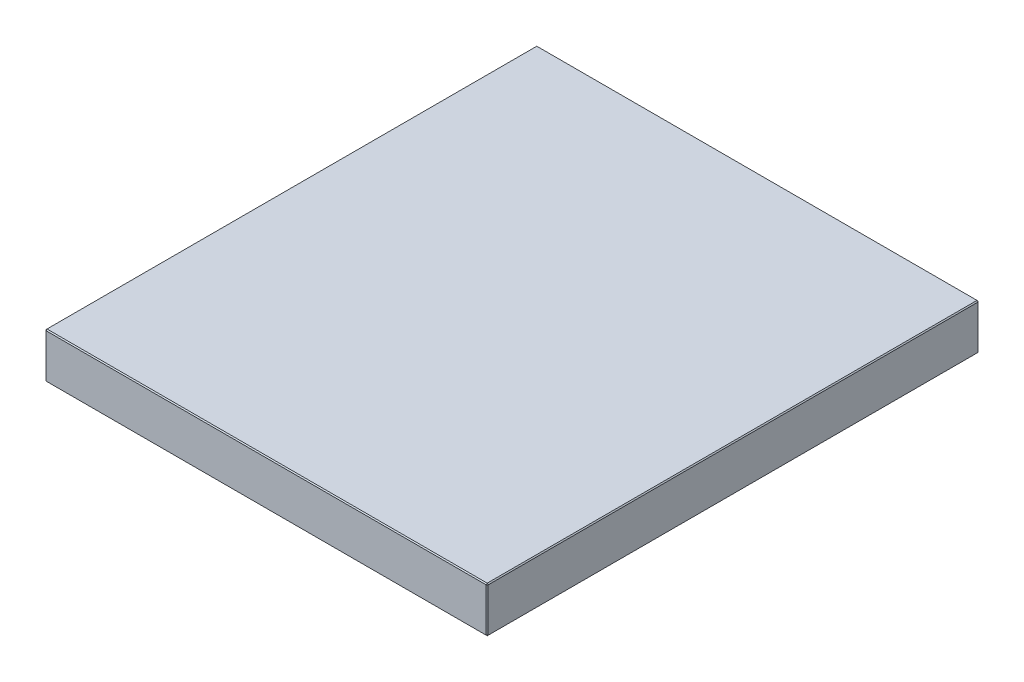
ISO-10303-21;
HEADER;
FILE_DESCRIPTION(('STEP AP214'),'2;1');
FILE_NAME('part.step','',(''),(''),'','','');
FILE_SCHEMA(('AUTOMOTIVE_DESIGN { 1 0 10303 214 1 1 1 1 }'));
ENDSEC;
DATA;
#1=APPLICATION_CONTEXT('core data for automotive mechanical design processes');
#2=APPLICATION_PROTOCOL_DEFINITION('international standard','automotive_design',2000,#1);
#3=PRODUCT_CONTEXT('',#1,'mechanical');
#4=PRODUCT('Part','Part','',(#3));
#5=PRODUCT_RELATED_PRODUCT_CATEGORY('part','',(#4));
#6=PRODUCT_DEFINITION_FORMATION('','',#4);
#7=PRODUCT_DEFINITION_CONTEXT('part definition',#1,'design');
#8=PRODUCT_DEFINITION('design','',#6,#7);
#9=PRODUCT_DEFINITION_SHAPE('','',#8);
#10=(LENGTH_UNIT() NAMED_UNIT(*) SI_UNIT(.MILLI.,.METRE.));
#11=(NAMED_UNIT(*) PLANE_ANGLE_UNIT() SI_UNIT($,.RADIAN.));
#12=(NAMED_UNIT(*) SI_UNIT($,.STERADIAN.) SOLID_ANGLE_UNIT());
#13=UNCERTAINTY_MEASURE_WITH_UNIT(LENGTH_MEASURE(1.E-05),#10,'distance_accuracy_value','');
#14=(GEOMETRIC_REPRESENTATION_CONTEXT(3) GLOBAL_UNCERTAINTY_ASSIGNED_CONTEXT((#13)) GLOBAL_UNIT_ASSIGNED_CONTEXT((#10,
#11,#12)) REPRESENTATION_CONTEXT('',''));
#15=CARTESIAN_POINT('',(0.,0.,0.));
#16=DIRECTION('',(0.,0.,1.));
#17=DIRECTION('',(1.,0.,0.));
#18=AXIS2_PLACEMENT_3D('',#15,#16,#17);
#19=CARTESIAN_POINT('',(-223.,46.,248.));
#20=DIRECTION('',(1.,0.,0.));
#21=DIRECTION('',(0.,0.,-1.));
#22=AXIS2_PLACEMENT_3D('',#19,#20,#21);
#23=PLANE('',#22);
#24=DIRECTION('',(0.,-1.,0.));
#25=VECTOR('',#24,1.);
#26=CARTESIAN_POINT('',(-223.,46.,-247.));
#27=LINE('',#26,#25);
#28=CARTESIAN_POINT('',(-223.,45.,-247.));
#29=VERTEX_POINT('',#28);
#30=CARTESIAN_POINT('',(-223.,1.00000000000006,-247.));
#31=VERTEX_POINT('',#30);
#32=EDGE_CURVE('E115',#29,#31,#27,.T.);
#33=ORIENTED_EDGE('',*,*,#32,.T.);
#34=DIRECTION('',(0.,0.,1.));
#35=VECTOR('',#34,1.);
#36=CARTESIAN_POINT('',(-223.,1.00000000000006,248.));
#37=LINE('',#36,#35);
#38=CARTESIAN_POINT('',(-223.,1.00000000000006,247.));
#39=VERTEX_POINT('',#38);
#40=EDGE_CURVE('E111',#31,#39,#37,.T.);
#41=ORIENTED_EDGE('',*,*,#40,.T.);
#42=DIRECTION('',(0.,1.,0.));
#43=VECTOR('',#42,1.);
#44=CARTESIAN_POINT('',(-223.,46.,247.));
#45=LINE('',#44,#43);
#46=CARTESIAN_POINT('',(-223.,45.,247.));
#47=VERTEX_POINT('',#46);
#48=EDGE_CURVE('E104',#39,#47,#45,.T.);
#49=ORIENTED_EDGE('',*,*,#48,.T.);
#50=DIRECTION('',(0.,0.,-1.));
#51=VECTOR('',#50,1.);
#52=CARTESIAN_POINT('',(-223.,45.,-248.));
#53=LINE('',#52,#51);
#54=EDGE_CURVE('E108',#47,#29,#53,.T.);
#55=ORIENTED_EDGE('',*,*,#54,.T.);
#56=EDGE_LOOP('',(#33,#41,#49,#55));
#57=FACE_BOUND('',#56,.T.);
#58=ADVANCED_FACE('F16',(#57),#23,.F.);
#59=CARTESIAN_POINT('',(223.,46.,248.));
#60=DIRECTION('',(0.,0.,-1.));
#61=DIRECTION('',(-1.,0.,0.));
#62=AXIS2_PLACEMENT_3D('',#59,#60,#61);
#63=PLANE('',#62);
#64=DIRECTION('',(-1.,0.,0.));
#65=VECTOR('',#64,1.);
#66=CARTESIAN_POINT('',(-223.,45.,248.));
#67=LINE('',#66,#65);
#68=CARTESIAN_POINT('',(222.,45.,248.));
#69=VERTEX_POINT('',#68);
#70=CARTESIAN_POINT('',(-222.,45.,248.));
#71=VERTEX_POINT('',#70);
#72=EDGE_CURVE('E165',#69,#71,#67,.T.);
#73=ORIENTED_EDGE('',*,*,#72,.T.);
#74=DIRECTION('',(0.,-1.,0.));
#75=VECTOR('',#74,1.);
#76=CARTESIAN_POINT('',(-222.,46.,248.));
#77=LINE('',#76,#75);
#78=CARTESIAN_POINT('',(-222.,1.00000000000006,248.));
#79=VERTEX_POINT('',#78);
#80=EDGE_CURVE('E123',#71,#79,#77,.T.);
#81=ORIENTED_EDGE('',*,*,#80,.T.);
#82=DIRECTION('',(1.,0.,0.));
#83=VECTOR('',#82,1.);
#84=CARTESIAN_POINT('',(223.,1.00000000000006,248.));
#85=LINE('',#84,#83);
#86=CARTESIAN_POINT('',(222.,1.00000000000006,248.));
#87=VERTEX_POINT('',#86);
#88=EDGE_CURVE('E169',#79,#87,#85,.T.);
#89=ORIENTED_EDGE('',*,*,#88,.T.);
#90=DIRECTION('',(0.,1.,0.));
#91=VECTOR('',#90,1.);
#92=CARTESIAN_POINT('',(222.,46.,248.));
#93=LINE('',#92,#91);
#94=EDGE_CURVE('E167',#87,#69,#93,.T.);
#95=ORIENTED_EDGE('',*,*,#94,.T.);
#96=EDGE_LOOP('',(#73,#81,#89,#95));
#97=FACE_BOUND('',#96,.T.);
#98=ADVANCED_FACE('F276',(#97),#63,.F.);
#99=CARTESIAN_POINT('',(223.,46.,248.));
#100=DIRECTION('',(-1.,0.,0.));
#101=DIRECTION('',(0.,0.,1.));
#102=AXIS2_PLACEMENT_3D('',#99,#100,#101);
#103=PLANE('',#102);
#104=DIRECTION('',(0.,0.,-1.));
#105=VECTOR('',#104,1.);
#106=CARTESIAN_POINT('',(223.,1.00000000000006,248.));
#107=LINE('',#106,#105);
#108=CARTESIAN_POINT('',(223.,1.00000000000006,247.));
#109=VERTEX_POINT('',#108);
#110=CARTESIAN_POINT('',(223.,1.00000000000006,-247.));
#111=VERTEX_POINT('',#110);
#112=EDGE_CURVE('E160',#109,#111,#107,.T.);
#113=ORIENTED_EDGE('',*,*,#112,.T.);
#114=DIRECTION('',(0.,1.,0.));
#115=VECTOR('',#114,1.);
#116=CARTESIAN_POINT('',(223.,46.,-247.));
#117=LINE('',#116,#115);
#118=CARTESIAN_POINT('',(223.,45.,-247.));
#119=VERTEX_POINT('',#118);
#120=EDGE_CURVE('E162',#111,#119,#117,.T.);
#121=ORIENTED_EDGE('',*,*,#120,.T.);
#122=DIRECTION('',(0.,0.,1.));
#123=VECTOR('',#122,1.);
#124=CARTESIAN_POINT('',(223.,45.,248.));
#125=LINE('',#124,#123);
#126=CARTESIAN_POINT('',(223.,45.,247.));
#127=VERTEX_POINT('',#126);
#128=EDGE_CURVE('E156',#119,#127,#125,.T.);
#129=ORIENTED_EDGE('',*,*,#128,.T.);
#130=DIRECTION('',(0.,-1.,0.));
#131=VECTOR('',#130,1.);
#132=CARTESIAN_POINT('',(223.,46.,247.));
#133=LINE('',#132,#131);
#134=EDGE_CURVE('E158',#127,#109,#133,.T.);
#135=ORIENTED_EDGE('',*,*,#134,.T.);
#136=EDGE_LOOP('',(#113,#121,#129,#135));
#137=FACE_BOUND('',#136,.T.);
#138=ADVANCED_FACE('F255',(#137),#103,.F.);
#139=CARTESIAN_POINT('',(223.,46.,-248.));
#140=DIRECTION('',(0.,0.,1.));
#141=DIRECTION('',(1.,0.,0.));
#142=AXIS2_PLACEMENT_3D('',#139,#140,#141);
#143=PLANE('',#142);
#144=DIRECTION('',(0.,-1.,0.));
#145=VECTOR('',#144,1.);
#146=CARTESIAN_POINT('',(222.,46.,-248.));
#147=LINE('',#146,#145);
#148=CARTESIAN_POINT('',(222.,45.,-248.));
#149=VERTEX_POINT('',#148);
#150=CARTESIAN_POINT('',(222.,1.00000000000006,-248.));
#151=VERTEX_POINT('',#150);
#152=EDGE_CURVE('E149',#149,#151,#147,.T.);
#153=ORIENTED_EDGE('',*,*,#152,.T.);
#154=DIRECTION('',(-1.,0.,0.));
#155=VECTOR('',#154,1.);
#156=CARTESIAN_POINT('',(223.,1.00000000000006,-248.));
#157=LINE('',#156,#155);
#158=CARTESIAN_POINT('',(-222.,1.00000000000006,-248.));
#159=VERTEX_POINT('',#158);
#160=EDGE_CURVE('E154',#151,#159,#157,.T.);
#161=ORIENTED_EDGE('',*,*,#160,.T.);
#162=DIRECTION('',(0.,1.,0.));
#163=VECTOR('',#162,1.);
#164=CARTESIAN_POINT('',(-222.,46.,-248.));
#165=LINE('',#164,#163);
#166=CARTESIAN_POINT('',(-222.,45.,-248.));
#167=VERTEX_POINT('',#166);
#168=EDGE_CURVE('E151',#159,#167,#165,.T.);
#169=ORIENTED_EDGE('',*,*,#168,.T.);
#170=DIRECTION('',(1.,0.,0.));
#171=VECTOR('',#170,1.);
#172=CARTESIAN_POINT('',(223.,45.,-248.));
#173=LINE('',#172,#171);
#174=EDGE_CURVE('E147',#167,#149,#173,.T.);
#175=ORIENTED_EDGE('',*,*,#174,.T.);
#176=EDGE_LOOP('',(#153,#161,#169,#175));
#177=FACE_BOUND('',#176,.T.);
#178=ADVANCED_FACE('F285',(#177),#143,.F.);
#179=CARTESIAN_POINT('',(0.,46.,0.));
#180=DIRECTION('',(0.,1.,0.));
#181=DIRECTION('',(0.,0.,1.));
#182=AXIS2_PLACEMENT_3D('',#179,#180,#181);
#183=PLANE('',#182);
#184=DIRECTION('',(0.,0.,-1.));
#185=VECTOR('',#184,1.);
#186=CARTESIAN_POINT('',(222.,46.,-248.));
#187=LINE('',#186,#185);
#188=CARTESIAN_POINT('',(222.,46.,247.));
#189=VERTEX_POINT('',#188);
#190=CARTESIAN_POINT('',(222.,46.,-247.));
#191=VERTEX_POINT('',#190);
#192=EDGE_CURVE('E25',#189,#191,#187,.T.);
#193=ORIENTED_EDGE('',*,*,#192,.T.);
#194=DIRECTION('',(-1.,0.,0.));
#195=VECTOR('',#194,1.);
#196=CARTESIAN_POINT('',(-223.,46.,-247.));
#197=LINE('',#196,#195);
#198=CARTESIAN_POINT('',(-222.,46.,-247.));
#199=VERTEX_POINT('',#198);
#200=EDGE_CURVE('E10',#191,#199,#197,.T.);
#201=ORIENTED_EDGE('',*,*,#200,.T.);
#202=DIRECTION('',(0.,0.,1.));
#203=VECTOR('',#202,1.);
#204=CARTESIAN_POINT('',(-222.,46.,248.));
#205=LINE('',#204,#203);
#206=CARTESIAN_POINT('',(-222.,46.,247.));
#207=VERTEX_POINT('',#206);
#208=EDGE_CURVE('E181',#199,#207,#205,.T.);
#209=ORIENTED_EDGE('',*,*,#208,.T.);
#210=DIRECTION('',(1.,0.,0.));
#211=VECTOR('',#210,1.);
#212=CARTESIAN_POINT('',(223.,46.,247.));
#213=LINE('',#212,#211);
#214=EDGE_CURVE('E36',#207,#189,#213,.T.);
#215=ORIENTED_EDGE('',*,*,#214,.T.);
#216=EDGE_LOOP('',(#193,#201,#209,#215));
#217=FACE_BOUND('',#216,.T.);
#218=ADVANCED_FACE('F351',(#217),#183,.T.);
#219=CARTESIAN_POINT('',(0.,0.,0.));
#220=DIRECTION('',(0.,1.,0.));
#221=DIRECTION('',(0.,0.,1.));
#222=AXIS2_PLACEMENT_3D('',#219,#220,#221);
#223=PLANE('',#222);
#224=DIRECTION('',(0.,0.,1.));
#225=VECTOR('',#224,1.);
#226=CARTESIAN_POINT('',(222.,0.,0.));
#227=LINE('',#226,#225);
#228=CARTESIAN_POINT('',(222.,0.,-247.));
#229=VERTEX_POINT('',#228);
#230=CARTESIAN_POINT('',(222.,0.,247.));
#231=VERTEX_POINT('',#230);
#232=EDGE_CURVE('E172',#229,#231,#227,.T.);
#233=ORIENTED_EDGE('',*,*,#232,.T.);
#234=DIRECTION('',(-1.,0.,0.));
#235=VECTOR('',#234,1.);
#236=CARTESIAN_POINT('',(0.,0.,247.));
#237=LINE('',#236,#235);
#238=CARTESIAN_POINT('',(-222.,0.,247.));
#239=VERTEX_POINT('',#238);
#240=EDGE_CURVE('E178',#231,#239,#237,.T.);
#241=ORIENTED_EDGE('',*,*,#240,.T.);
#242=DIRECTION('',(0.,0.,-1.));
#243=VECTOR('',#242,1.);
#244=CARTESIAN_POINT('',(-222.,0.,0.));
#245=LINE('',#244,#243);
#246=CARTESIAN_POINT('',(-222.,0.,-247.));
#247=VERTEX_POINT('',#246);
#248=EDGE_CURVE('E176',#239,#247,#245,.T.);
#249=ORIENTED_EDGE('',*,*,#248,.T.);
#250=DIRECTION('',(1.,0.,0.));
#251=VECTOR('',#250,1.);
#252=CARTESIAN_POINT('',(0.,0.,-247.));
#253=LINE('',#252,#251);
#254=EDGE_CURVE('E174',#247,#229,#253,.T.);
#255=ORIENTED_EDGE('',*,*,#254,.T.);
#256=EDGE_LOOP('',(#233,#241,#249,#255));
#257=FACE_BOUND('',#256,.T.);
#258=ADVANCED_FACE('F247',(#257),#223,.F.);
#259=CARTESIAN_POINT('',(223.,46.,247.));
#260=DIRECTION('',(-0.707106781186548,0.,-0.707106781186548));
#261=DIRECTION('',(0.,-1.,0.));
#262=AXIS2_PLACEMENT_3D('',#259,#260,#261);
#263=PLANE('',#262);
#264=DIRECTION('',(-0.707106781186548,0.,0.707106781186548));
#265=VECTOR('',#264,1.);
#266=CARTESIAN_POINT('',(222.,45.,248.));
#267=LINE('',#266,#265);
#268=EDGE_CURVE('E20',#69,#127,#267,.F.);
#269=ORIENTED_EDGE('',*,*,#268,.F.);
#270=ORIENTED_EDGE('',*,*,#94,.F.);
#271=DIRECTION('',(0.707106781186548,0.,-0.707106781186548));
#272=VECTOR('',#271,1.);
#273=CARTESIAN_POINT('',(222.,1.00000000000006,248.));
#274=LINE('',#273,#272);
#275=EDGE_CURVE('E143',#109,#87,#274,.F.);
#276=ORIENTED_EDGE('',*,*,#275,.F.);
#277=ORIENTED_EDGE('',*,*,#134,.F.);
#278=EDGE_LOOP('',(#269,#270,#276,#277));
#279=FACE_BOUND('',#278,.T.);
#280=ADVANCED_FACE('F18',(#279),#263,.F.);
#281=CARTESIAN_POINT('',(222.,45.,248.));
#282=DIRECTION('',(0.577350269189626,0.577350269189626,0.577350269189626));
#283=DIRECTION('',(0.707106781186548,0.,-0.707106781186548));
#284=AXIS2_PLACEMENT_3D('',#281,#282,#283);
#285=PLANE('',#284);
#286=DIRECTION('',(0.,-0.707106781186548,0.707106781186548));
#287=VECTOR('',#286,1.);
#288=CARTESIAN_POINT('',(222.,45.,248.));
#289=LINE('',#288,#287);
#290=EDGE_CURVE('E227',#69,#189,#289,.F.);
#291=ORIENTED_EDGE('',*,*,#290,.F.);
#292=ORIENTED_EDGE('',*,*,#268,.T.);
#293=DIRECTION('',(-0.707106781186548,0.707106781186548,0.));
#294=VECTOR('',#293,1.);
#295=CARTESIAN_POINT('',(222.5,45.5,247.));
#296=LINE('',#295,#294);
#297=EDGE_CURVE('E229',#189,#127,#296,.F.);
#298=ORIENTED_EDGE('',*,*,#297,.F.);
#299=EDGE_LOOP('',(#291,#292,#298));
#300=FACE_BOUND('',#299,.T.);
#301=ADVANCED_FACE('F271',(#300),#285,.T.);
#302=CARTESIAN_POINT('',(222.,1.00000000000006,248.));
#303=DIRECTION('',(0.577350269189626,-0.577350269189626,0.577350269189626));
#304=DIRECTION('',(0.707106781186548,0.,-0.707106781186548));
#305=AXIS2_PLACEMENT_3D('',#302,#303,#304);
#306=PLANE('',#305);
#307=DIRECTION('',(-0.707106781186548,-0.707106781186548,0.));
#308=VECTOR('',#307,1.);
#309=CARTESIAN_POINT('',(222.5,0.500000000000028,247.));
#310=LINE('',#309,#308);
#311=EDGE_CURVE('E221',#109,#231,#310,.T.);
#312=ORIENTED_EDGE('',*,*,#311,.F.);
#313=ORIENTED_EDGE('',*,*,#275,.T.);
#314=DIRECTION('',(0.,0.707106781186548,0.707106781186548));
#315=VECTOR('',#314,1.);
#316=CARTESIAN_POINT('',(222.,1.00000000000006,248.));
#317=LINE('',#316,#315);
#318=EDGE_CURVE('E224',#231,#87,#317,.T.);
#319=ORIENTED_EDGE('',*,*,#318,.F.);
#320=EDGE_LOOP('',(#312,#313,#319));
#321=FACE_BOUND('',#320,.T.);
#322=ADVANCED_FACE('F236',(#321),#306,.T.);
#323=CARTESIAN_POINT('',(222.,46.,0.));
#324=DIRECTION('',(0.707106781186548,0.707106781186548,0.));
#325=DIRECTION('',(0.,0.,1.));
#326=AXIS2_PLACEMENT_3D('',#323,#324,#325);
#327=PLANE('',#326);
#328=ORIENTED_EDGE('',*,*,#297,.T.);
#329=ORIENTED_EDGE('',*,*,#128,.F.);
#330=DIRECTION('',(0.707106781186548,-0.707106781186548,0.));
#331=VECTOR('',#330,1.);
#332=CARTESIAN_POINT('',(223.,45.,-247.));
#333=LINE('',#332,#331);
#334=EDGE_CURVE('E216',#191,#119,#333,.T.);
#335=ORIENTED_EDGE('',*,*,#334,.F.);
#336=ORIENTED_EDGE('',*,*,#192,.F.);
#337=EDGE_LOOP('',(#328,#329,#335,#336));
#338=FACE_BOUND('',#337,.T.);
#339=ADVANCED_FACE('F266',(#338),#327,.T.);
#340=CARTESIAN_POINT('',(0.,46.,247.));
#341=DIRECTION('',(0.,0.707106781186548,0.707106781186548));
#342=DIRECTION('',(-1.,0.,0.));
#343=AXIS2_PLACEMENT_3D('',#340,#341,#342);
#344=PLANE('',#343);
#345=ORIENTED_EDGE('',*,*,#290,.T.);
#346=ORIENTED_EDGE('',*,*,#214,.F.);
#347=DIRECTION('',(0.,0.707106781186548,-0.707106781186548));
#348=VECTOR('',#347,1.);
#349=CARTESIAN_POINT('',(-222.,45.5,247.5));
#350=LINE('',#349,#348);
#351=EDGE_CURVE('E127',#71,#207,#350,.T.);
#352=ORIENTED_EDGE('',*,*,#351,.F.);
#353=ORIENTED_EDGE('',*,*,#72,.F.);
#354=EDGE_LOOP('',(#345,#346,#352,#353));
#355=FACE_BOUND('',#354,.T.);
#356=ADVANCED_FACE('F274',(#355),#344,.T.);
#357=CARTESIAN_POINT('',(-222.,46.,248.));
#358=DIRECTION('',(0.707106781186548,0.,-0.707106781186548));
#359=DIRECTION('',(0.,-1.,0.));
#360=AXIS2_PLACEMENT_3D('',#357,#358,#359);
#361=PLANE('',#360);
#362=DIRECTION('',(0.707106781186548,0.,0.707106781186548));
#363=VECTOR('',#362,1.);
#364=CARTESIAN_POINT('',(-222.,1.00000000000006,248.));
#365=LINE('',#364,#363);
#366=EDGE_CURVE('E128',#79,#39,#365,.F.);
#367=ORIENTED_EDGE('',*,*,#366,.F.);
#368=ORIENTED_EDGE('',*,*,#80,.F.);
#369=DIRECTION('',(-0.707106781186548,0.,-0.707106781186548));
#370=VECTOR('',#369,1.);
#371=CARTESIAN_POINT('',(-223.,45.,247.));
#372=LINE('',#371,#370);
#373=EDGE_CURVE('E119',#47,#71,#372,.F.);
#374=ORIENTED_EDGE('',*,*,#373,.F.);
#375=ORIENTED_EDGE('',*,*,#48,.F.);
#376=EDGE_LOOP('',(#367,#368,#374,#375));
#377=FACE_BOUND('',#376,.T.);
#378=ADVANCED_FACE('F121',(#377),#361,.F.);
#379=CARTESIAN_POINT('',(223.,1.00000000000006,248.));
#380=DIRECTION('',(0.,0.707106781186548,-0.707106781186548));
#381=DIRECTION('',(1.,0.,0.));
#382=AXIS2_PLACEMENT_3D('',#379,#380,#381);
#383=PLANE('',#382);
#384=ORIENTED_EDGE('',*,*,#318,.T.);
#385=ORIENTED_EDGE('',*,*,#88,.F.);
#386=DIRECTION('',(0.,-0.707106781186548,-0.707106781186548));
#387=VECTOR('',#386,1.);
#388=CARTESIAN_POINT('',(-222.,1.00000000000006,248.));
#389=LINE('',#388,#387);
#390=EDGE_CURVE('E212',#239,#79,#389,.F.);
#391=ORIENTED_EDGE('',*,*,#390,.F.);
#392=ORIENTED_EDGE('',*,*,#240,.F.);
#393=EDGE_LOOP('',(#384,#385,#391,#392));
#394=FACE_BOUND('',#393,.T.);
#395=ADVANCED_FACE('F244',(#394),#383,.F.);
#396=CARTESIAN_POINT('',(223.,1.00000000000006,248.));
#397=DIRECTION('',(-0.707106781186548,0.707106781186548,0.));
#398=DIRECTION('',(0.,0.,-1.));
#399=AXIS2_PLACEMENT_3D('',#396,#397,#398);
#400=PLANE('',#399);
#401=ORIENTED_EDGE('',*,*,#311,.T.);
#402=ORIENTED_EDGE('',*,*,#232,.F.);
#403=DIRECTION('',(0.707106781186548,0.707106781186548,0.));
#404=VECTOR('',#403,1.);
#405=CARTESIAN_POINT('',(222.5,0.500000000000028,-247.));
#406=LINE('',#405,#404);
#407=EDGE_CURVE('E209',#111,#229,#406,.F.);
#408=ORIENTED_EDGE('',*,*,#407,.F.);
#409=ORIENTED_EDGE('',*,*,#112,.F.);
#410=EDGE_LOOP('',(#401,#402,#408,#409));
#411=FACE_BOUND('',#410,.T.);
#412=ADVANCED_FACE('F252',(#411),#400,.F.);
#413=CARTESIAN_POINT('',(222.,46.,-248.));
#414=DIRECTION('',(-0.707106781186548,0.,0.707106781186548));
#415=DIRECTION('',(0.,-1.,0.));
#416=AXIS2_PLACEMENT_3D('',#413,#414,#415);
#417=PLANE('',#416);
#418=DIRECTION('',(0.707106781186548,0.,0.707106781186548));
#419=VECTOR('',#418,1.);
#420=CARTESIAN_POINT('',(223.,45.,-247.));
#421=LINE('',#420,#419);
#422=EDGE_CURVE('E218',#119,#149,#421,.F.);
#423=ORIENTED_EDGE('',*,*,#422,.F.);
#424=ORIENTED_EDGE('',*,*,#120,.F.);
#425=DIRECTION('',(-0.707106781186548,0.,-0.707106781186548));
#426=VECTOR('',#425,1.);
#427=CARTESIAN_POINT('',(222.,1.00000000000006,-248.));
#428=LINE('',#427,#426);
#429=EDGE_CURVE('E206',#151,#111,#428,.F.);
#430=ORIENTED_EDGE('',*,*,#429,.F.);
#431=ORIENTED_EDGE('',*,*,#152,.F.);
#432=EDGE_LOOP('',(#423,#424,#430,#431));
#433=FACE_BOUND('',#432,.T.);
#434=ADVANCED_FACE('F259',(#433),#417,.F.);
#435=CARTESIAN_POINT('',(223.,45.,-247.));
#436=DIRECTION('',(0.577350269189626,0.577350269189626,-0.577350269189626));
#437=DIRECTION('',(-0.707106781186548,0.,-0.707106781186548));
#438=AXIS2_PLACEMENT_3D('',#435,#436,#437);
#439=PLANE('',#438);
#440=ORIENTED_EDGE('',*,*,#334,.T.);
#441=ORIENTED_EDGE('',*,*,#422,.T.);
#442=DIRECTION('',(0.,0.707106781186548,0.707106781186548));
#443=VECTOR('',#442,1.);
#444=CARTESIAN_POINT('',(222.,45.5,-247.5));
#445=LINE('',#444,#443);
#446=EDGE_CURVE('E135',#191,#149,#445,.F.);
#447=ORIENTED_EDGE('',*,*,#446,.F.);
#448=EDGE_LOOP('',(#440,#441,#447));
#449=FACE_BOUND('',#448,.T.);
#450=ADVANCED_FACE('F326',(#449),#439,.T.);
#451=CARTESIAN_POINT('',(-223.,45.,247.));
#452=DIRECTION('',(-0.577350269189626,0.577350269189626,0.577350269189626));
#453=DIRECTION('',(0.707106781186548,0.,0.707106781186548));
#454=AXIS2_PLACEMENT_3D('',#451,#452,#453);
#455=PLANE('',#454);
#456=ORIENTED_EDGE('',*,*,#373,.T.);
#457=ORIENTED_EDGE('',*,*,#351,.T.);
#458=DIRECTION('',(-0.707106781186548,-0.707106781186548,0.));
#459=VECTOR('',#458,1.);
#460=CARTESIAN_POINT('',(-223.,45.,247.));
#461=LINE('',#460,#459);
#462=EDGE_CURVE('E131',#47,#207,#461,.F.);
#463=ORIENTED_EDGE('',*,*,#462,.F.);
#464=EDGE_LOOP('',(#456,#457,#463));
#465=FACE_BOUND('',#464,.T.);
#466=ADVANCED_FACE('F132',(#465),#455,.T.);
#467=CARTESIAN_POINT('',(-222.,1.00000000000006,248.));
#468=DIRECTION('',(-0.577350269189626,-0.577350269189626,0.577350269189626));
#469=DIRECTION('',(0.707106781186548,0.,0.707106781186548));
#470=AXIS2_PLACEMENT_3D('',#467,#468,#469);
#471=PLANE('',#470);
#472=ORIENTED_EDGE('',*,*,#390,.T.);
#473=ORIENTED_EDGE('',*,*,#366,.T.);
#474=DIRECTION('',(-0.707106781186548,0.707106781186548,0.));
#475=VECTOR('',#474,1.);
#476=CARTESIAN_POINT('',(-222.5,0.500000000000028,247.));
#477=LINE('',#476,#475);
#478=EDGE_CURVE('E136',#239,#39,#477,.T.);
#479=ORIENTED_EDGE('',*,*,#478,.F.);
#480=EDGE_LOOP('',(#472,#473,#479));
#481=FACE_BOUND('',#480,.T.);
#482=ADVANCED_FACE('F319',(#481),#471,.T.);
#483=CARTESIAN_POINT('',(222.,1.00000000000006,-248.));
#484=DIRECTION('',(0.577350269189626,-0.577350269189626,-0.577350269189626));
#485=DIRECTION('',(-0.707106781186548,0.,-0.707106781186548));
#486=AXIS2_PLACEMENT_3D('',#483,#484,#485);
#487=PLANE('',#486);
#488=ORIENTED_EDGE('',*,*,#429,.T.);
#489=ORIENTED_EDGE('',*,*,#407,.T.);
#490=DIRECTION('',(0.,-0.707106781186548,0.707106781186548));
#491=VECTOR('',#490,1.);
#492=CARTESIAN_POINT('',(222.,1.00000000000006,-248.));
#493=LINE('',#492,#491);
#494=EDGE_CURVE('E199',#151,#229,#493,.T.);
#495=ORIENTED_EDGE('',*,*,#494,.F.);
#496=EDGE_LOOP('',(#488,#489,#495));
#497=FACE_BOUND('',#496,.T.);
#498=ADVANCED_FACE('F315',(#497),#487,.T.);
#499=CARTESIAN_POINT('',(0.,46.,-247.));
#500=DIRECTION('',(0.,0.707106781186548,-0.707106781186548));
#501=DIRECTION('',(1.,0.,0.));
#502=AXIS2_PLACEMENT_3D('',#499,#500,#501);
#503=PLANE('',#502);
#504=ORIENTED_EDGE('',*,*,#446,.T.);
#505=ORIENTED_EDGE('',*,*,#174,.F.);
#506=DIRECTION('',(0.,-0.707106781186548,-0.707106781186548));
#507=VECTOR('',#506,1.);
#508=CARTESIAN_POINT('',(-222.,45.,-248.));
#509=LINE('',#508,#507);
#510=EDGE_CURVE('E196',#199,#167,#509,.T.);
#511=ORIENTED_EDGE('',*,*,#510,.F.);
#512=ORIENTED_EDGE('',*,*,#200,.F.);
#513=EDGE_LOOP('',(#504,#505,#511,#512));
#514=FACE_BOUND('',#513,.T.);
#515=ADVANCED_FACE('F312',(#514),#503,.T.);
#516=CARTESIAN_POINT('',(-222.,46.,0.));
#517=DIRECTION('',(-0.707106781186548,0.707106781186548,0.));
#518=DIRECTION('',(0.,0.,-1.));
#519=AXIS2_PLACEMENT_3D('',#516,#517,#518);
#520=PLANE('',#519);
#521=ORIENTED_EDGE('',*,*,#462,.T.);
#522=ORIENTED_EDGE('',*,*,#208,.F.);
#523=DIRECTION('',(0.707106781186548,0.707106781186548,0.));
#524=VECTOR('',#523,1.);
#525=CARTESIAN_POINT('',(-222.5,45.5,-247.));
#526=LINE('',#525,#524);
#527=EDGE_CURVE('E139',#29,#199,#526,.T.);
#528=ORIENTED_EDGE('',*,*,#527,.F.);
#529=ORIENTED_EDGE('',*,*,#54,.F.);
#530=EDGE_LOOP('',(#521,#522,#528,#529));
#531=FACE_BOUND('',#530,.T.);
#532=ADVANCED_FACE('F138',(#531),#520,.T.);
#533=CARTESIAN_POINT('',(-223.,1.00000000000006,248.));
#534=DIRECTION('',(0.707106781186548,0.707106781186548,0.));
#535=DIRECTION('',(0.,0.,1.));
#536=AXIS2_PLACEMENT_3D('',#533,#534,#535);
#537=PLANE('',#536);
#538=ORIENTED_EDGE('',*,*,#478,.T.);
#539=ORIENTED_EDGE('',*,*,#40,.F.);
#540=DIRECTION('',(0.707106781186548,-0.707106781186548,0.));
#541=VECTOR('',#540,1.);
#542=CARTESIAN_POINT('',(-223.,1.00000000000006,-247.));
#543=LINE('',#542,#541);
#544=EDGE_CURVE('E192',#247,#31,#543,.F.);
#545=ORIENTED_EDGE('',*,*,#544,.F.);
#546=ORIENTED_EDGE('',*,*,#248,.F.);
#547=EDGE_LOOP('',(#538,#539,#545,#546));
#548=FACE_BOUND('',#547,.T.);
#549=ADVANCED_FACE('F305',(#548),#537,.F.);
#550=CARTESIAN_POINT('',(223.,1.00000000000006,-248.));
#551=DIRECTION('',(0.,0.707106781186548,0.707106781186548));
#552=DIRECTION('',(-1.,0.,0.));
#553=AXIS2_PLACEMENT_3D('',#550,#551,#552);
#554=PLANE('',#553);
#555=ORIENTED_EDGE('',*,*,#494,.T.);
#556=ORIENTED_EDGE('',*,*,#254,.F.);
#557=DIRECTION('',(0.,0.707106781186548,-0.707106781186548));
#558=VECTOR('',#557,1.);
#559=CARTESIAN_POINT('',(-222.,0.500000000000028,-247.5));
#560=LINE('',#559,#558);
#561=EDGE_CURVE('E189',#159,#247,#560,.F.);
#562=ORIENTED_EDGE('',*,*,#561,.F.);
#563=ORIENTED_EDGE('',*,*,#160,.F.);
#564=EDGE_LOOP('',(#555,#556,#562,#563));
#565=FACE_BOUND('',#564,.T.);
#566=ADVANCED_FACE('F301',(#565),#554,.F.);
#567=CARTESIAN_POINT('',(-222.,45.,-248.));
#568=DIRECTION('',(-0.577350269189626,0.577350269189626,-0.577350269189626));
#569=DIRECTION('',(-0.707106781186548,0.,0.707106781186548));
#570=AXIS2_PLACEMENT_3D('',#567,#568,#569);
#571=PLANE('',#570);
#572=ORIENTED_EDGE('',*,*,#527,.T.);
#573=ORIENTED_EDGE('',*,*,#510,.T.);
#574=DIRECTION('',(0.707106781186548,0.,-0.707106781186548));
#575=VECTOR('',#574,1.);
#576=CARTESIAN_POINT('',(-222.,45.,-248.));
#577=LINE('',#576,#575);
#578=EDGE_CURVE('E187',#29,#167,#577,.T.);
#579=ORIENTED_EDGE('',*,*,#578,.F.);
#580=EDGE_LOOP('',(#572,#573,#579));
#581=FACE_BOUND('',#580,.T.);
#582=ADVANCED_FACE('F297',(#581),#571,.T.);
#583=CARTESIAN_POINT('',(-223.,1.00000000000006,-247.));
#584=DIRECTION('',(-0.577350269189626,-0.577350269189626,-0.577350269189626));
#585=DIRECTION('',(-0.707106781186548,0.,0.707106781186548));
#586=AXIS2_PLACEMENT_3D('',#583,#584,#585);
#587=PLANE('',#586);
#588=ORIENTED_EDGE('',*,*,#561,.T.);
#589=ORIENTED_EDGE('',*,*,#544,.T.);
#590=DIRECTION('',(-0.707106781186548,0.,0.707106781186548));
#591=VECTOR('',#590,1.);
#592=CARTESIAN_POINT('',(-223.,1.00000000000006,-247.));
#593=LINE('',#592,#591);
#594=EDGE_CURVE('E185',#159,#31,#593,.T.);
#595=ORIENTED_EDGE('',*,*,#594,.F.);
#596=EDGE_LOOP('',(#588,#589,#595));
#597=FACE_BOUND('',#596,.T.);
#598=ADVANCED_FACE('F293',(#597),#587,.T.);
#599=CARTESIAN_POINT('',(-223.,46.,-247.));
#600=DIRECTION('',(0.707106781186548,0.,0.707106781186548));
#601=DIRECTION('',(0.,-1.,0.));
#602=AXIS2_PLACEMENT_3D('',#599,#600,#601);
#603=PLANE('',#602);
#604=ORIENTED_EDGE('',*,*,#578,.T.);
#605=ORIENTED_EDGE('',*,*,#168,.F.);
#606=ORIENTED_EDGE('',*,*,#594,.T.);
#607=ORIENTED_EDGE('',*,*,#32,.F.);
#608=EDGE_LOOP('',(#604,#605,#606,#607));
#609=FACE_BOUND('',#608,.T.);
#610=ADVANCED_FACE('F290',(#609),#603,.F.);
#611=CLOSED_SHELL('',(#58,#98,#138,#178,#218,#258,#280,#301,#322,#339,#356,#378,#395,#412,#434,
#450,#466,#482,#498,#515,#532,#549,#566,#582,#598,#610));
#612=MANIFOLD_SOLID_BREP('B1',#611);
#613=ADVANCED_BREP_SHAPE_REPRESENTATION('',(#18,#612),#14);
#614=SHAPE_DEFINITION_REPRESENTATION(#9,#613);
ENDSEC;
END-ISO-10303-21;
